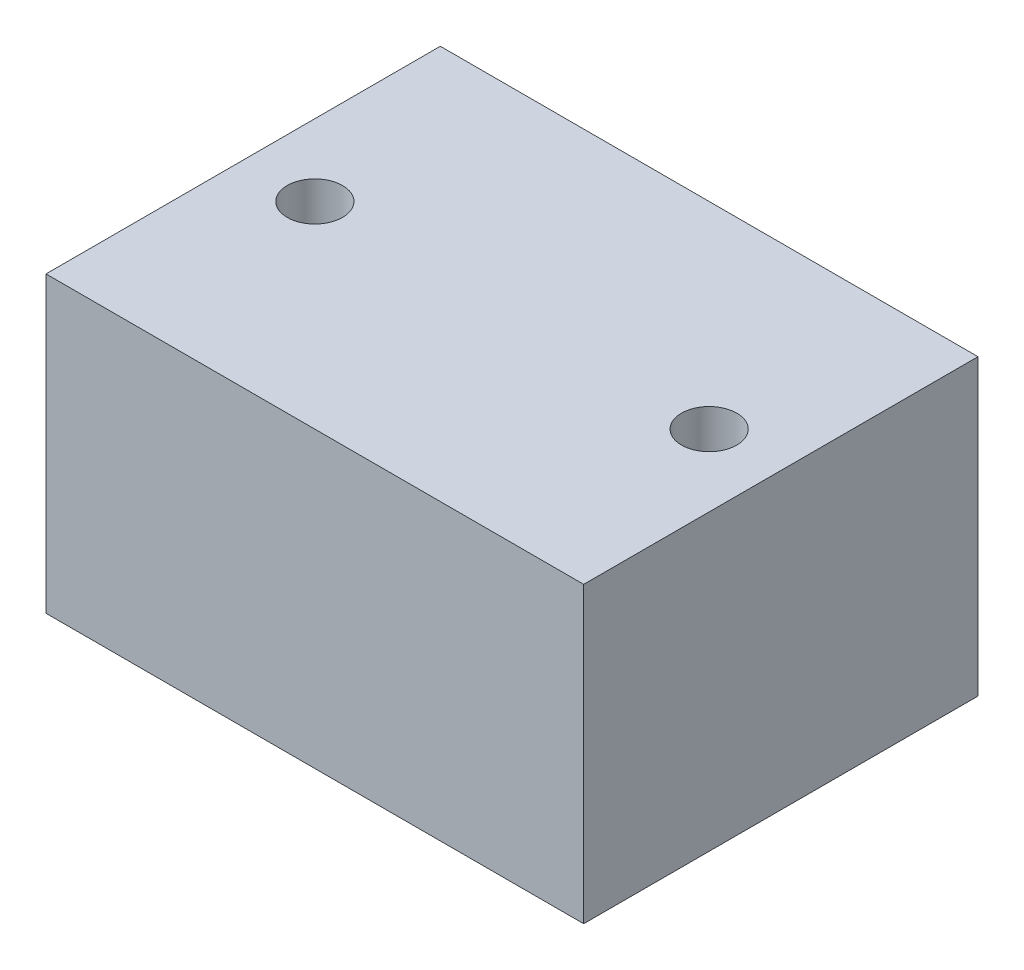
ISO-10303-21;
HEADER;
FILE_DESCRIPTION(('STEP AP214'),'2;1');
FILE_NAME('part.step','',(''),(''),'','','');
FILE_SCHEMA(('AUTOMOTIVE_DESIGN { 1 0 10303 214 1 1 1 1 }'));
ENDSEC;
DATA;
#1=APPLICATION_CONTEXT('core data for automotive mechanical design processes');
#2=APPLICATION_PROTOCOL_DEFINITION('international standard','automotive_design',2000,#1);
#3=PRODUCT_CONTEXT('',#1,'mechanical');
#4=PRODUCT('Part','Part','',(#3));
#5=PRODUCT_RELATED_PRODUCT_CATEGORY('part','',(#4));
#6=PRODUCT_DEFINITION_FORMATION('','',#4);
#7=PRODUCT_DEFINITION_CONTEXT('part definition',#1,'design');
#8=PRODUCT_DEFINITION('design','',#6,#7);
#9=PRODUCT_DEFINITION_SHAPE('','',#8);
#10=(LENGTH_UNIT() NAMED_UNIT(*) SI_UNIT(.MILLI.,.METRE.));
#11=(NAMED_UNIT(*) PLANE_ANGLE_UNIT() SI_UNIT($,.RADIAN.));
#12=(NAMED_UNIT(*) SI_UNIT($,.STERADIAN.) SOLID_ANGLE_UNIT());
#13=UNCERTAINTY_MEASURE_WITH_UNIT(LENGTH_MEASURE(1.E-05),#10,'distance_accuracy_value','');
#14=(GEOMETRIC_REPRESENTATION_CONTEXT(3) GLOBAL_UNCERTAINTY_ASSIGNED_CONTEXT((#13)) GLOBAL_UNIT_ASSIGNED_CONTEXT((#10,
#11,#12)) REPRESENTATION_CONTEXT('',''));
#15=CARTESIAN_POINT('',(0.,0.,0.));
#16=DIRECTION('',(0.,0.,1.));
#17=DIRECTION('',(1.,0.,0.));
#18=AXIS2_PLACEMENT_3D('',#15,#16,#17);
#19=CARTESIAN_POINT('',(-47.625,26.035,34.925));
#20=DIRECTION('',(1.,0.,0.));
#21=DIRECTION('',(0.,0.,-1.));
#22=AXIS2_PLACEMENT_3D('',#19,#20,#21);
#23=PLANE('',#22);
#24=DIRECTION('',(0.,-1.,0.));
#25=VECTOR('',#24,1.);
#26=CARTESIAN_POINT('',(-47.625,26.035,-34.925));
#27=LINE('',#26,#25);
#28=CARTESIAN_POINT('',(-47.625,26.035,-34.925));
#29=VERTEX_POINT('',#28);
#30=CARTESIAN_POINT('',(-47.625,-26.035,-34.925));
#31=VERTEX_POINT('',#30);
#32=EDGE_CURVE('E96',#29,#31,#27,.T.);
#33=ORIENTED_EDGE('',*,*,#32,.T.);
#34=DIRECTION('',(0.,0.,-1.));
#35=VECTOR('',#34,1.);
#36=CARTESIAN_POINT('',(-47.625,-26.035,34.925));
#37=LINE('',#36,#35);
#38=CARTESIAN_POINT('',(-47.625,-26.035,34.925));
#39=VERTEX_POINT('',#38);
#40=EDGE_CURVE('E11',#39,#31,#37,.T.);
#41=ORIENTED_EDGE('',*,*,#40,.F.);
#42=DIRECTION('',(0.,-1.,0.));
#43=VECTOR('',#42,1.);
#44=CARTESIAN_POINT('',(-47.625,26.035,34.925));
#45=LINE('',#44,#43);
#46=CARTESIAN_POINT('',(-47.625,26.035,34.925));
#47=VERTEX_POINT('',#46);
#48=EDGE_CURVE('E84',#47,#39,#45,.T.);
#49=ORIENTED_EDGE('',*,*,#48,.F.);
#50=DIRECTION('',(0.,0.,-1.));
#51=VECTOR('',#50,1.);
#52=CARTESIAN_POINT('',(-47.625,26.035,34.925));
#53=LINE('',#52,#51);
#54=EDGE_CURVE('E92',#47,#29,#53,.T.);
#55=ORIENTED_EDGE('',*,*,#54,.T.);
#56=EDGE_LOOP('',(#33,#41,#49,#55));
#57=FACE_BOUND('',#56,.T.);
#58=ADVANCED_FACE('F33',(#57),#23,.F.);
#59=CARTESIAN_POINT('',(-47.625,-26.035,34.925));
#60=DIRECTION('',(0.,1.,0.));
#61=DIRECTION('',(0.,0.,1.));
#62=AXIS2_PLACEMENT_3D('',#59,#60,#61);
#63=PLANE('',#62);
#64=CARTESIAN_POINT('',(-34.925,-26.035,0.));
#65=DIRECTION('',(0.,1.,0.));
#66=DIRECTION('',(0.,0.,1.));
#67=AXIS2_PLACEMENT_3D('',#64,#65,#66);
#68=CIRCLE('',#67,4.90219999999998);
#69=CARTESIAN_POINT('',(-34.925,-26.035,4.90219999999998));
#70=VERTEX_POINT('',#69);
#71=EDGE_CURVE('E115',#70,#70,#68,.T.);
#72=ORIENTED_EDGE('',*,*,#71,.T.);
#73=EDGE_LOOP('',(#72));
#74=FACE_BOUND('',#73,.T.);
#75=CARTESIAN_POINT('',(34.925,-26.035,0.));
#76=DIRECTION('',(0.,1.,0.));
#77=DIRECTION('',(0.,0.,1.));
#78=AXIS2_PLACEMENT_3D('',#75,#76,#77);
#79=CIRCLE('',#78,4.90219999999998);
#80=CARTESIAN_POINT('',(34.925,-26.035,4.90219999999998));
#81=VERTEX_POINT('',#80);
#82=EDGE_CURVE('E99',#81,#81,#79,.T.);
#83=ORIENTED_EDGE('',*,*,#82,.T.);
#84=EDGE_LOOP('',(#83));
#85=FACE_BOUND('',#84,.T.);
#86=DIRECTION('',(1.,0.,0.));
#87=VECTOR('',#86,1.);
#88=CARTESIAN_POINT('',(-47.625,-26.035,-34.925));
#89=LINE('',#88,#87);
#90=CARTESIAN_POINT('',(47.625,-26.035,-34.925));
#91=VERTEX_POINT('',#90);
#92=EDGE_CURVE('E88',#31,#91,#89,.T.);
#93=ORIENTED_EDGE('',*,*,#92,.T.);
#94=DIRECTION('',(0.,0.,-1.));
#95=VECTOR('',#94,1.);
#96=CARTESIAN_POINT('',(47.625,-26.035,34.925));
#97=LINE('',#96,#95);
#98=CARTESIAN_POINT('',(47.625,-26.035,34.925));
#99=VERTEX_POINT('',#98);
#100=EDGE_CURVE('E41',#99,#91,#97,.T.);
#101=ORIENTED_EDGE('',*,*,#100,.F.);
#102=DIRECTION('',(1.,0.,0.));
#103=VECTOR('',#102,1.);
#104=CARTESIAN_POINT('',(-47.625,-26.035,34.925));
#105=LINE('',#104,#103);
#106=EDGE_CURVE('E79',#39,#99,#105,.T.);
#107=ORIENTED_EDGE('',*,*,#106,.F.);
#108=ORIENTED_EDGE('',*,*,#40,.T.);
#109=EDGE_LOOP('',(#93,#101,#107,#108));
#110=FACE_BOUND('',#109,.T.);
#111=ADVANCED_FACE('F87',(#74,#85,#110),#63,.F.);
#112=CARTESIAN_POINT('',(47.625,26.035,34.925));
#113=DIRECTION('',(-1.,0.,0.));
#114=DIRECTION('',(0.,0.,1.));
#115=AXIS2_PLACEMENT_3D('',#112,#113,#114);
#116=PLANE('',#115);
#117=DIRECTION('',(0.,1.,0.));
#118=VECTOR('',#117,1.);
#119=CARTESIAN_POINT('',(47.625,26.035,-34.925));
#120=LINE('',#119,#118);
#121=CARTESIAN_POINT('',(47.625,26.035,-34.925));
#122=VERTEX_POINT('',#121);
#123=EDGE_CURVE('E66',#91,#122,#120,.T.);
#124=ORIENTED_EDGE('',*,*,#123,.T.);
#125=DIRECTION('',(0.,0.,-1.));
#126=VECTOR('',#125,1.);
#127=CARTESIAN_POINT('',(47.625,26.035,34.925));
#128=LINE('',#127,#126);
#129=CARTESIAN_POINT('',(47.625,26.035,34.925));
#130=VERTEX_POINT('',#129);
#131=EDGE_CURVE('E89',#130,#122,#128,.T.);
#132=ORIENTED_EDGE('',*,*,#131,.F.);
#133=DIRECTION('',(0.,1.,0.));
#134=VECTOR('',#133,1.);
#135=CARTESIAN_POINT('',(47.625,26.035,34.925));
#136=LINE('',#135,#134);
#137=EDGE_CURVE('E82',#99,#130,#136,.T.);
#138=ORIENTED_EDGE('',*,*,#137,.F.);
#139=ORIENTED_EDGE('',*,*,#100,.T.);
#140=EDGE_LOOP('',(#124,#132,#138,#139));
#141=FACE_BOUND('',#140,.T.);
#142=ADVANCED_FACE('F90',(#141),#116,.F.);
#143=CARTESIAN_POINT('',(-47.625,26.035,34.925));
#144=DIRECTION('',(0.,-1.,0.));
#145=DIRECTION('',(0.,0.,-1.));
#146=AXIS2_PLACEMENT_3D('',#143,#144,#145);
#147=PLANE('',#146);
#148=CARTESIAN_POINT('',(-34.925,26.035,0.));
#149=DIRECTION('',(0.,1.,0.));
#150=DIRECTION('',(0.,0.,1.));
#151=AXIS2_PLACEMENT_3D('',#148,#149,#150);
#152=CIRCLE('',#151,4.90219999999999);
#153=CARTESIAN_POINT('',(-34.925,26.035,4.90219999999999));
#154=VERTEX_POINT('',#153);
#155=EDGE_CURVE('E118',#154,#154,#152,.T.);
#156=ORIENTED_EDGE('',*,*,#155,.F.);
#157=EDGE_LOOP('',(#156));
#158=FACE_BOUND('',#157,.T.);
#159=CARTESIAN_POINT('',(34.925,26.035,0.));
#160=DIRECTION('',(0.,1.,0.));
#161=DIRECTION('',(0.,0.,1.));
#162=AXIS2_PLACEMENT_3D('',#159,#160,#161);
#163=CIRCLE('',#162,4.90219999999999);
#164=CARTESIAN_POINT('',(34.925,26.035,4.90219999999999));
#165=VERTEX_POINT('',#164);
#166=EDGE_CURVE('E112',#165,#165,#163,.T.);
#167=ORIENTED_EDGE('',*,*,#166,.F.);
#168=EDGE_LOOP('',(#167));
#169=FACE_BOUND('',#168,.T.);
#170=DIRECTION('',(-1.,0.,0.));
#171=VECTOR('',#170,1.);
#172=CARTESIAN_POINT('',(-47.625,26.035,-34.925));
#173=LINE('',#172,#171);
#174=EDGE_CURVE('E72',#122,#29,#173,.T.);
#175=ORIENTED_EDGE('',*,*,#174,.T.);
#176=ORIENTED_EDGE('',*,*,#54,.F.);
#177=DIRECTION('',(-1.,0.,0.));
#178=VECTOR('',#177,1.);
#179=CARTESIAN_POINT('',(-47.625,26.035,34.925));
#180=LINE('',#179,#178);
#181=EDGE_CURVE('E49',#130,#47,#180,.T.);
#182=ORIENTED_EDGE('',*,*,#181,.F.);
#183=ORIENTED_EDGE('',*,*,#131,.T.);
#184=EDGE_LOOP('',(#175,#176,#182,#183));
#185=FACE_BOUND('',#184,.T.);
#186=ADVANCED_FACE('F104',(#158,#169,#185),#147,.F.);
#187=CARTESIAN_POINT('',(0.,0.,34.925));
#188=DIRECTION('',(0.,0.,1.));
#189=DIRECTION('',(1.,0.,0.));
#190=AXIS2_PLACEMENT_3D('',#187,#188,#189);
#191=PLANE('',#190);
#192=ORIENTED_EDGE('',*,*,#48,.T.);
#193=ORIENTED_EDGE('',*,*,#106,.T.);
#194=ORIENTED_EDGE('',*,*,#137,.T.);
#195=ORIENTED_EDGE('',*,*,#181,.T.);
#196=EDGE_LOOP('',(#192,#193,#194,#195));
#197=FACE_BOUND('',#196,.T.);
#198=ADVANCED_FACE('F80',(#197),#191,.T.);
#199=CARTESIAN_POINT('',(0.,0.,-34.925));
#200=DIRECTION('',(0.,0.,1.));
#201=DIRECTION('',(1.,0.,0.));
#202=AXIS2_PLACEMENT_3D('',#199,#200,#201);
#203=PLANE('',#202);
#204=ORIENTED_EDGE('',*,*,#32,.F.);
#205=ORIENTED_EDGE('',*,*,#174,.F.);
#206=ORIENTED_EDGE('',*,*,#123,.F.);
#207=ORIENTED_EDGE('',*,*,#92,.F.);
#208=EDGE_LOOP('',(#204,#205,#206,#207));
#209=FACE_BOUND('',#208,.T.);
#210=ADVANCED_FACE('F107',(#209),#203,.F.);
#211=CARTESIAN_POINT('',(34.925,26.035,0.));
#212=DIRECTION('',(0.,1.,0.));
#213=DIRECTION('',(0.,0.,1.));
#214=AXIS2_PLACEMENT_3D('',#211,#212,#213);
#215=CYLINDRICAL_SURFACE('',#214,4.90219999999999);
#216=ORIENTED_EDGE('',*,*,#82,.F.);
#217=EDGE_LOOP('',(#216));
#218=FACE_BOUND('',#217,.T.);
#219=ORIENTED_EDGE('',*,*,#166,.T.);
#220=EDGE_LOOP('',(#219));
#221=FACE_BOUND('',#220,.T.);
#222=ADVANCED_FACE('F129',(#218,#221),#215,.F.);
#223=CARTESIAN_POINT('',(-34.925,26.035,0.));
#224=DIRECTION('',(0.,1.,0.));
#225=DIRECTION('',(0.,0.,1.));
#226=AXIS2_PLACEMENT_3D('',#223,#224,#225);
#227=CYLINDRICAL_SURFACE('',#226,4.90219999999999);
#228=ORIENTED_EDGE('',*,*,#71,.F.);
#229=EDGE_LOOP('',(#228));
#230=FACE_BOUND('',#229,.T.);
#231=ORIENTED_EDGE('',*,*,#155,.T.);
#232=EDGE_LOOP('',(#231));
#233=FACE_BOUND('',#232,.T.);
#234=ADVANCED_FACE('F122',(#230,#233),#227,.F.);
#235=CLOSED_SHELL('',(#58,#111,#142,#186,#198,#210,#222,#234));
#236=MANIFOLD_SOLID_BREP('B2',#235);
#237=ADVANCED_BREP_SHAPE_REPRESENTATION('',(#18,#236),#14);
#238=SHAPE_DEFINITION_REPRESENTATION(#9,#237);
ENDSEC;
END-ISO-10303-21;
